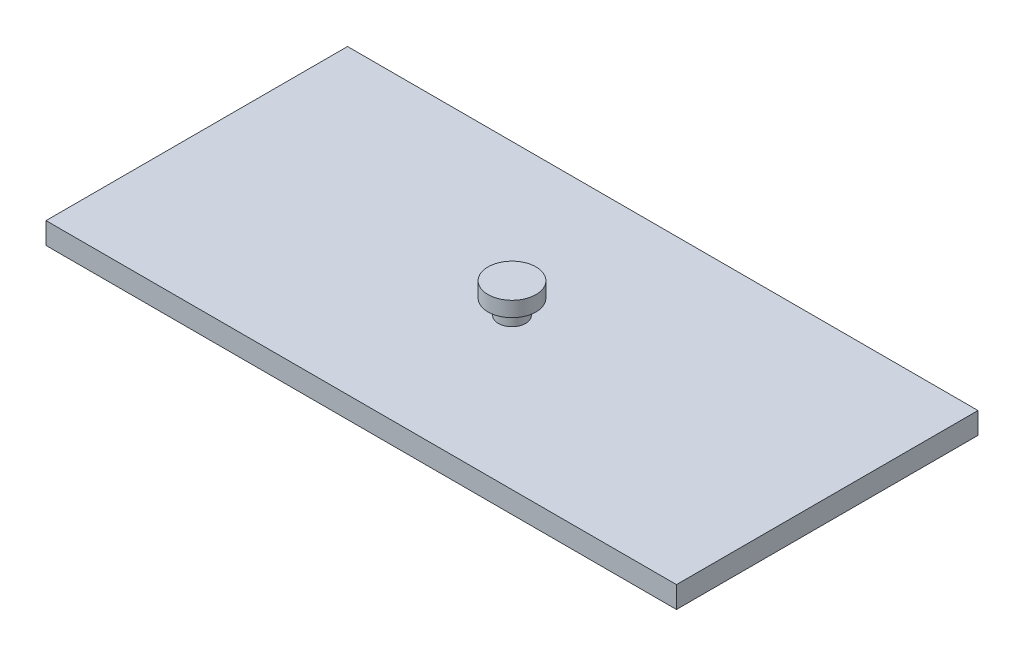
from build123d import *

# Parameters (mm, degrees)
SKETCH1_W               = 116.84
SKETCH1_H               = 55.88
BOSS_EXTRUDE1_DEPTH     = 3.999992
SKETCH4_R               = 2.54
BOSS_EXTRUDE3_DEPTH     = 2.794
SKETCH5_R               = 4.445
BOSS_EXTRUDE4_DEPTH     = 2.794
SKETCH10_W              = 10.16
SKETCH10_H              = 10.16
BOSS_EXTRUDE6_DEPTH     = 2.794
MIRROR4_COPY_1_SKETCH_W = 10.16
MIRROR4_COPY_1_SKETCH_H = 10.16
MIRROR4_COPY_1_DEPTH    = 2.794


with BuildPart() as part:
    # Sketch1 → Boss-Extrude1 (new body)
    with BuildSketch(Plane(origin=(0, 0, 0), x_dir=(1, 0, 0), z_dir=(0, 1, 0))):
        Rectangle(SKETCH1_W, SKETCH1_H)
    extrude(amount=BOSS_EXTRUDE1_DEPTH)

    # Sketch4 → Boss-Extrude3 (add)
    with BuildSketch(Plane(origin=(0, 3.999992, 0), x_dir=(1, 0, 0), z_dir=(0, 1, 0))):
        with Locations(Location((0, 0, 0), (0, 0, 270))):
            Circle(SKETCH4_R)
    extrude(amount=BOSS_EXTRUDE3_DEPTH)

    # Sketch5 → Boss-Extrude4 (add)
    with BuildSketch(Plane(origin=(0, 6.793992, 0), x_dir=(1, 0, 0), z_dir=(0, 1, 0))):
        with Locations(Location((0, 0, 0), (0, 0, 270))):
            Circle(SKETCH5_R)
    extrude(amount=BOSS_EXTRUDE4_DEPTH)

    # Sketch10 → Boss-Extrude6 (add)
    with BuildSketch(Plane.XZ):
        with Locations((-50.546, 20.066)):
            Rectangle(SKETCH10_W, SKETCH10_H)
    boss_extrude6 = extrude(amount=BOSS_EXTRUDE6_DEPTH)

    # Mirror3: Boss-Extrude6 across plane
    add(boss_extrude6.mirror(Plane(origin=(0, 0, 0), x_dir=(0, 0, 1), z_dir=(1, 0, 0))))

    # Mirror4: Boss-Extrude6 across plane
    add(boss_extrude6.mirror(Plane.XY))

    # Mirror4 copy 1 sketch → Mirror4 copy 1 (add)
    with BuildSketch(Plane(origin=(0, 0, 0), x_dir=(-1, 0, 0), z_dir=(0, -1, 0))):
        with Locations((-50.546, 20.066)):
            Rectangle(MIRROR4_COPY_1_SKETCH_W, MIRROR4_COPY_1_SKETCH_H)
    extrude(amount=MIRROR4_COPY_1_DEPTH)


solid = part.part
